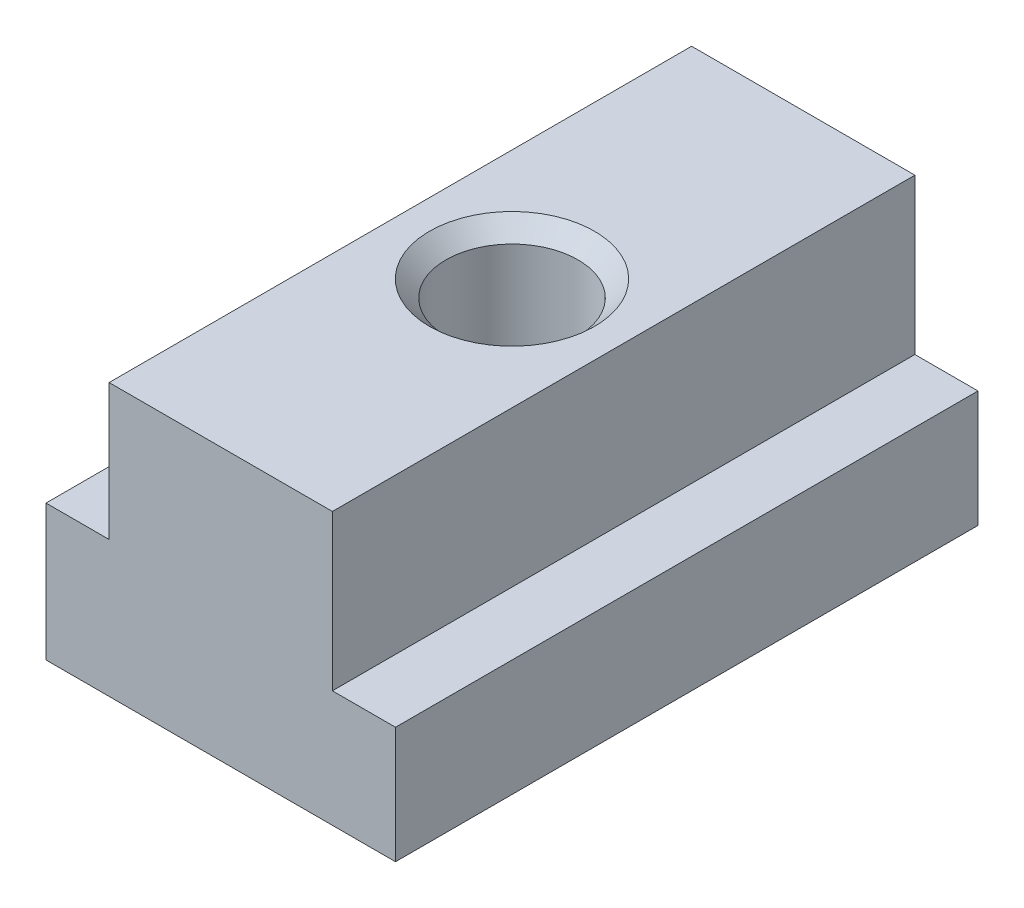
from build123d import *

# Parameters (mm, degrees)
AUFSATZ_LINEAR_AUSTRAGEN1_DEPTH = 30


with BuildPart() as part:
    # Skizze1 → Aufsatz-Linear austragen1 (new body)
    with BuildSketch(Plane.XY):
        Polygon((0, 0), (18, 0), (18, 6), (14.75, 6), (14.75, 14), (3.25, 14), (3.25, 7), (0, 7), align=None)
    extrude(amount=AUFSATZ_LINEAR_AUSTRAGEN1_DEPTH)

    # Skizze2 → M8 Gewindebohrung1 (revolve, cut)
    with BuildSketch(Plane(origin=(9, 14, 15), x_dir=(0, 0, 1), z_dir=(1, 0, 0))):
        Polygon((0, 0), (0, 14), (4.25, 14), (3.4, 13.15), (3.4, 0.85), (4.25, 0), align=None)
    revolve(axis=Axis((9, 20.35, 15), (0, -1, 0)), mode=Mode.SUBTRACT)


solid = part.part
